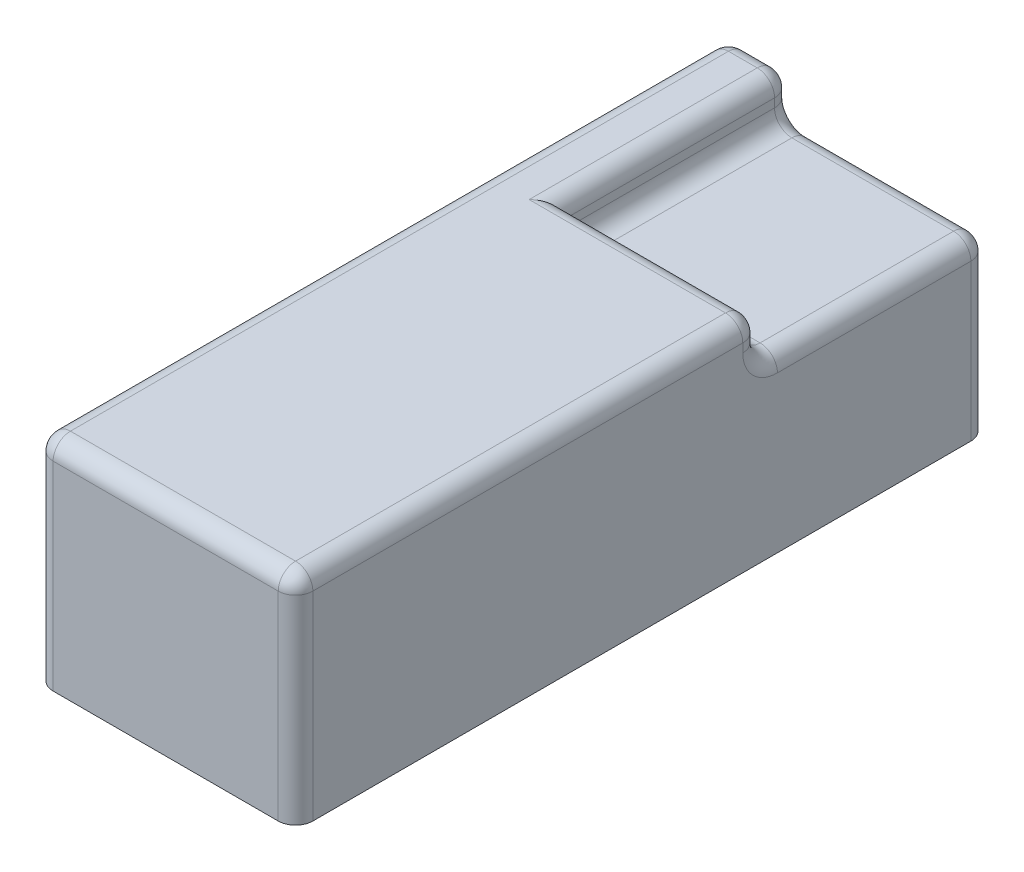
ISO-10303-21;
HEADER;
FILE_DESCRIPTION(('STEP AP214'),'2;1');
FILE_NAME('part.step','',(''),(''),'','','');
FILE_SCHEMA(('AUTOMOTIVE_DESIGN { 1 0 10303 214 1 1 1 1 }'));
ENDSEC;
DATA;
#1=APPLICATION_CONTEXT('core data for automotive mechanical design processes');
#2=APPLICATION_PROTOCOL_DEFINITION('international standard','automotive_design',2000,#1);
#3=PRODUCT_CONTEXT('',#1,'mechanical');
#4=PRODUCT('Part','Part','',(#3));
#5=PRODUCT_RELATED_PRODUCT_CATEGORY('part','',(#4));
#6=PRODUCT_DEFINITION_FORMATION('','',#4);
#7=PRODUCT_DEFINITION_CONTEXT('part definition',#1,'design');
#8=PRODUCT_DEFINITION('design','',#6,#7);
#9=PRODUCT_DEFINITION_SHAPE('','',#8);
#10=(LENGTH_UNIT() NAMED_UNIT(*) SI_UNIT(.MILLI.,.METRE.));
#11=(NAMED_UNIT(*) PLANE_ANGLE_UNIT() SI_UNIT($,.RADIAN.));
#12=(NAMED_UNIT(*) SI_UNIT($,.STERADIAN.) SOLID_ANGLE_UNIT());
#13=UNCERTAINTY_MEASURE_WITH_UNIT(LENGTH_MEASURE(1.E-05),#10,'distance_accuracy_value','');
#14=(GEOMETRIC_REPRESENTATION_CONTEXT(3) GLOBAL_UNCERTAINTY_ASSIGNED_CONTEXT((#13)) GLOBAL_UNIT_ASSIGNED_CONTEXT((#10,
#11,#12)) REPRESENTATION_CONTEXT('',''));
#15=CARTESIAN_POINT('',(0.,0.,0.));
#16=DIRECTION('',(0.,0.,1.));
#17=DIRECTION('',(1.,0.,0.));
#18=AXIS2_PLACEMENT_3D('',#15,#16,#17);
#19=CARTESIAN_POINT('',(0.,0.,-80.));
#20=DIRECTION('',(0.,-1.,0.));
#21=DIRECTION('',(0.,0.,-1.));
#22=AXIS2_PLACEMENT_3D('',#19,#20,#21);
#23=PLANE('',#22);
#24=DIRECTION('',(0.,0.,-1.));
#25=VECTOR('',#24,1.);
#26=CARTESIAN_POINT('',(30.,0.,0.));
#27=LINE('',#26,#25);
#28=CARTESIAN_POINT('',(30.,0.,-2.));
#29=VERTEX_POINT('',#28);
#30=CARTESIAN_POINT('',(30.,0.,-78.));
#31=VERTEX_POINT('',#30);
#32=EDGE_CURVE('E212',#29,#31,#27,.T.);
#33=ORIENTED_EDGE('',*,*,#32,.F.);
#34=CARTESIAN_POINT('',(28.,0.,-2.));
#35=DIRECTION('',(0.,-1.,0.));
#36=DIRECTION('',(0.,0.,-1.));
#37=AXIS2_PLACEMENT_3D('',#34,#35,#36);
#38=CIRCLE('',#37,2.);
#39=CARTESIAN_POINT('',(28.,0.,0.));
#40=VERTEX_POINT('',#39);
#41=EDGE_CURVE('E246',#29,#40,#38,.T.);
#42=ORIENTED_EDGE('',*,*,#41,.T.);
#43=DIRECTION('',(1.,0.,0.));
#44=VECTOR('',#43,1.);
#45=CARTESIAN_POINT('',(0.,0.,0.));
#46=LINE('',#45,#44);
#47=CARTESIAN_POINT('',(2.,0.,0.));
#48=VERTEX_POINT('',#47);
#49=EDGE_CURVE('E358',#48,#40,#46,.T.);
#50=ORIENTED_EDGE('',*,*,#49,.F.);
#51=CARTESIAN_POINT('',(2.,0.,-2.));
#52=DIRECTION('',(0.,-1.,0.));
#53=DIRECTION('',(0.,0.,-1.));
#54=AXIS2_PLACEMENT_3D('',#51,#52,#53);
#55=CIRCLE('',#54,2.);
#56=CARTESIAN_POINT('',(0.,0.,-2.));
#57=VERTEX_POINT('',#56);
#58=EDGE_CURVE('E244',#48,#57,#55,.T.);
#59=ORIENTED_EDGE('',*,*,#58,.T.);
#60=DIRECTION('',(0.,0.,1.));
#61=VECTOR('',#60,1.);
#62=CARTESIAN_POINT('',(0.,0.,0.));
#63=LINE('',#62,#61);
#64=CARTESIAN_POINT('',(0.,0.,-78.));
#65=VERTEX_POINT('',#64);
#66=EDGE_CURVE('E266',#65,#57,#63,.T.);
#67=ORIENTED_EDGE('',*,*,#66,.F.);
#68=CARTESIAN_POINT('',(2.,0.,-78.));
#69=DIRECTION('',(0.,-1.,0.));
#70=DIRECTION('',(0.,0.,-1.));
#71=AXIS2_PLACEMENT_3D('',#68,#69,#70);
#72=CIRCLE('',#71,2.);
#73=CARTESIAN_POINT('',(2.,0.,-80.));
#74=VERTEX_POINT('',#73);
#75=EDGE_CURVE('E240',#65,#74,#72,.T.);
#76=ORIENTED_EDGE('',*,*,#75,.T.);
#77=DIRECTION('',(-1.,0.,0.));
#78=VECTOR('',#77,1.);
#79=CARTESIAN_POINT('',(0.,0.,-80.));
#80=LINE('',#79,#78);
#81=CARTESIAN_POINT('',(28.,0.,-80.));
#82=VERTEX_POINT('',#81);
#83=EDGE_CURVE('E208',#82,#74,#80,.T.);
#84=ORIENTED_EDGE('',*,*,#83,.F.);
#85=CARTESIAN_POINT('',(28.,0.,-78.));
#86=DIRECTION('',(0.,-1.,0.));
#87=DIRECTION('',(0.,0.,-1.));
#88=AXIS2_PLACEMENT_3D('',#85,#86,#87);
#89=CIRCLE('',#88,2.);
#90=EDGE_CURVE('E242',#82,#31,#89,.T.);
#91=ORIENTED_EDGE('',*,*,#90,.T.);
#92=EDGE_LOOP('',(#33,#42,#50,#59,#67,#76,#84,#91));
#93=FACE_BOUND('',#92,.T.);
#94=CARTESIAN_POINT('',(15.,0.,-71.6553218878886));
#95=DIRECTION('',(0.,-1.,0.));
#96=DIRECTION('',(0.,0.,-1.));
#97=AXIS2_PLACEMENT_3D('',#94,#95,#96);
#98=CIRCLE('',#97,4.41834885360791);
#99=CARTESIAN_POINT('',(15.,0.,-76.0736707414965));
#100=VERTEX_POINT('',#99);
#101=EDGE_CURVE('E354',#100,#100,#98,.T.);
#102=ORIENTED_EDGE('',*,*,#101,.F.);
#103=EDGE_LOOP('',(#102));
#104=FACE_BOUND('',#103,.T.);
#105=ADVANCED_FACE('F39',(#93,#104),#23,.T.);
#106=CARTESIAN_POINT('',(28.,25.,-78.));
#107=DIRECTION('',(0.,-1.,0.));
#108=DIRECTION('',(0.,0.,-1.));
#109=AXIS2_PLACEMENT_3D('',#106,#107,#108);
#110=CYLINDRICAL_SURFACE('',#109,2.);
#111=DIRECTION('',(0.,-1.,0.));
#112=VECTOR('',#111,1.);
#113=CARTESIAN_POINT('',(28.,25.,-80.));
#114=LINE('',#113,#112);
#115=CARTESIAN_POINT('',(28.,18.,-80.));
#116=VERTEX_POINT('',#115);
#117=EDGE_CURVE('E219',#116,#82,#114,.T.);
#118=ORIENTED_EDGE('',*,*,#117,.F.);
#119=CARTESIAN_POINT('',(28.,18.,-78.));
#120=DIRECTION('',(0.,-1.,0.));
#121=DIRECTION('',(0.,0.,-1.));
#122=AXIS2_PLACEMENT_3D('',#119,#120,#121);
#123=CIRCLE('',#122,2.);
#124=CARTESIAN_POINT('',(30.,18.,-78.));
#125=VERTEX_POINT('',#124);
#126=EDGE_CURVE('E11',#116,#125,#123,.T.);
#127=ORIENTED_EDGE('',*,*,#126,.T.);
#128=DIRECTION('',(0.,-1.,0.));
#129=VECTOR('',#128,1.);
#130=CARTESIAN_POINT('',(30.,25.,-78.));
#131=LINE('',#130,#129);
#132=EDGE_CURVE('E221',#31,#125,#131,.F.);
#133=ORIENTED_EDGE('',*,*,#132,.F.);
#134=ORIENTED_EDGE('',*,*,#90,.F.);
#135=EDGE_LOOP('',(#118,#127,#133,#134));
#136=FACE_BOUND('',#135,.T.);
#137=ADVANCED_FACE('F371',(#136),#110,.T.);
#138=CARTESIAN_POINT('',(0.,25.,0.));
#139=DIRECTION('',(1.,0.,0.));
#140=DIRECTION('',(0.,0.,-1.));
#141=AXIS2_PLACEMENT_3D('',#138,#139,#140);
#142=PLANE('',#141);
#143=ORIENTED_EDGE('',*,*,#66,.T.);
#144=DIRECTION('',(0.,-1.,0.));
#145=VECTOR('',#144,1.);
#146=CARTESIAN_POINT('',(0.,25.,-2.));
#147=LINE('',#146,#145);
#148=CARTESIAN_POINT('',(0.,23.,-2.));
#149=VERTEX_POINT('',#148);
#150=EDGE_CURVE('E238',#57,#149,#147,.F.);
#151=ORIENTED_EDGE('',*,*,#150,.T.);
#152=DIRECTION('',(0.,0.,1.));
#153=VECTOR('',#152,1.);
#154=CARTESIAN_POINT('',(0.,23.,0.));
#155=LINE('',#154,#153);
#156=CARTESIAN_POINT('',(0.,23.,-78.));
#157=VERTEX_POINT('',#156);
#158=EDGE_CURVE('E236',#149,#157,#155,.F.);
#159=ORIENTED_EDGE('',*,*,#158,.T.);
#160=DIRECTION('',(0.,-1.,0.));
#161=VECTOR('',#160,1.);
#162=CARTESIAN_POINT('',(0.,25.,-78.));
#163=LINE('',#162,#161);
#164=EDGE_CURVE('E234',#157,#65,#163,.T.);
#165=ORIENTED_EDGE('',*,*,#164,.T.);
#166=EDGE_LOOP('',(#143,#151,#159,#165));
#167=FACE_BOUND('',#166,.T.);
#168=ADVANCED_FACE('F435',(#167),#142,.F.);
#169=CARTESIAN_POINT('',(0.,25.,0.));
#170=DIRECTION('',(0.,0.,-1.));
#171=DIRECTION('',(-1.,0.,0.));
#172=AXIS2_PLACEMENT_3D('',#169,#170,#171);
#173=PLANE('',#172);
#174=ORIENTED_EDGE('',*,*,#49,.T.);
#175=DIRECTION('',(0.,-1.,0.));
#176=VECTOR('',#175,1.);
#177=CARTESIAN_POINT('',(28.,25.,0.));
#178=LINE('',#177,#176);
#179=CARTESIAN_POINT('',(28.,23.,0.));
#180=VERTEX_POINT('',#179);
#181=EDGE_CURVE('E232',#40,#180,#178,.F.);
#182=ORIENTED_EDGE('',*,*,#181,.T.);
#183=DIRECTION('',(1.,0.,0.));
#184=VECTOR('',#183,1.);
#185=CARTESIAN_POINT('',(0.,23.,0.));
#186=LINE('',#185,#184);
#187=CARTESIAN_POINT('',(2.,23.,0.));
#188=VERTEX_POINT('',#187);
#189=EDGE_CURVE('E230',#180,#188,#186,.F.);
#190=ORIENTED_EDGE('',*,*,#189,.T.);
#191=DIRECTION('',(0.,-1.,0.));
#192=VECTOR('',#191,1.);
#193=CARTESIAN_POINT('',(2.,25.,0.));
#194=LINE('',#193,#192);
#195=EDGE_CURVE('E228',#188,#48,#194,.T.);
#196=ORIENTED_EDGE('',*,*,#195,.T.);
#197=EDGE_LOOP('',(#174,#182,#190,#196));
#198=FACE_BOUND('',#197,.T.);
#199=ADVANCED_FACE('F444',(#198),#173,.F.);
#200=CARTESIAN_POINT('',(30.,25.,0.));
#201=DIRECTION('',(-1.,0.,0.));
#202=DIRECTION('',(0.,0.,1.));
#203=AXIS2_PLACEMENT_3D('',#200,#201,#202);
#204=PLANE('',#203);
#205=CARTESIAN_POINT('',(30.,22.,-55.6549345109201));
#206=DIRECTION('',(-1.,0.,0.));
#207=DIRECTION('',(0.,0.,1.));
#208=AXIS2_PLACEMENT_3D('',#205,#206,#207);
#209=CIRCLE('',#208,4.);
#210=CARTESIAN_POINT('',(30.,22.,-51.6549345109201));
#211=VERTEX_POINT('',#210);
#212=CARTESIAN_POINT('',(30.,18.,-55.6549345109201));
#213=VERTEX_POINT('',#212);
#214=EDGE_CURVE('E286',#211,#213,#209,.F.);
#215=ORIENTED_EDGE('',*,*,#214,.F.);
#216=DIRECTION('',(0.,1.,0.));
#217=VECTOR('',#216,1.);
#218=CARTESIAN_POINT('',(30.,25.,-51.6549345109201));
#219=LINE('',#218,#217);
#220=CARTESIAN_POINT('',(30.,23.,-51.6549345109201));
#221=VERTEX_POINT('',#220);
#222=EDGE_CURVE('E291',#211,#221,#219,.T.);
#223=ORIENTED_EDGE('',*,*,#222,.T.);
#224=DIRECTION('',(0.,0.,-1.));
#225=VECTOR('',#224,1.);
#226=CARTESIAN_POINT('',(30.,23.,0.));
#227=LINE('',#226,#225);
#228=CARTESIAN_POINT('',(30.,23.,-2.));
#229=VERTEX_POINT('',#228);
#230=EDGE_CURVE('E224',#221,#229,#227,.F.);
#231=ORIENTED_EDGE('',*,*,#230,.T.);
#232=DIRECTION('',(0.,-1.,0.));
#233=VECTOR('',#232,1.);
#234=CARTESIAN_POINT('',(30.,25.,-2.));
#235=LINE('',#234,#233);
#236=EDGE_CURVE('E226',#229,#29,#235,.T.);
#237=ORIENTED_EDGE('',*,*,#236,.T.);
#238=ORIENTED_EDGE('',*,*,#32,.T.);
#239=ORIENTED_EDGE('',*,*,#132,.T.);
#240=DIRECTION('',(0.,0.,-1.));
#241=VECTOR('',#240,1.);
#242=CARTESIAN_POINT('',(30.,18.,-53.6549345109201));
#243=LINE('',#242,#241);
#244=EDGE_CURVE('E289',#125,#213,#243,.F.);
#245=ORIENTED_EDGE('',*,*,#244,.T.);
#246=EDGE_LOOP('',(#215,#223,#231,#237,#238,#239,#245));
#247=FACE_BOUND('',#246,.T.);
#248=ADVANCED_FACE('F364',(#247),#204,.F.);
#249=CARTESIAN_POINT('',(0.,25.,-80.));
#250=DIRECTION('',(0.,0.,1.));
#251=DIRECTION('',(1.,0.,0.));
#252=AXIS2_PLACEMENT_3D('',#249,#250,#251);
#253=PLANE('',#252);
#254=DIRECTION('',(-1.,0.,0.));
#255=VECTOR('',#254,1.);
#256=CARTESIAN_POINT('',(0.,23.,-80.));
#257=LINE('',#256,#255);
#258=CARTESIAN_POINT('',(2.,23.,-80.));
#259=VERTEX_POINT('',#258);
#260=CARTESIAN_POINT('',(5.32456832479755,23.,-80.));
#261=VERTEX_POINT('',#260);
#262=EDGE_CURVE('E190',#259,#261,#257,.F.);
#263=ORIENTED_EDGE('',*,*,#262,.T.);
#264=DIRECTION('',(0.,-1.,0.));
#265=VECTOR('',#264,1.);
#266=CARTESIAN_POINT('',(5.32456832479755,25.,-80.));
#267=LINE('',#266,#265);
#268=CARTESIAN_POINT('',(5.32456832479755,22.,-80.));
#269=VERTEX_POINT('',#268);
#270=EDGE_CURVE('E298',#261,#269,#267,.T.);
#271=ORIENTED_EDGE('',*,*,#270,.T.);
#272=CARTESIAN_POINT('',(9.32456832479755,22.,-80.));
#273=DIRECTION('',(0.,0.,1.));
#274=DIRECTION('',(1.,0.,0.));
#275=AXIS2_PLACEMENT_3D('',#272,#273,#274);
#276=CIRCLE('',#275,4.);
#277=CARTESIAN_POINT('',(9.32456832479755,18.,-80.));
#278=VERTEX_POINT('',#277);
#279=EDGE_CURVE('E295',#278,#269,#276,.F.);
#280=ORIENTED_EDGE('',*,*,#279,.F.);
#281=DIRECTION('',(-1.,0.,0.));
#282=VECTOR('',#281,1.);
#283=CARTESIAN_POINT('',(28.,18.,-80.));
#284=LINE('',#283,#282);
#285=EDGE_CURVE('E293',#278,#116,#284,.F.);
#286=ORIENTED_EDGE('',*,*,#285,.T.);
#287=ORIENTED_EDGE('',*,*,#117,.T.);
#288=ORIENTED_EDGE('',*,*,#83,.T.);
#289=DIRECTION('',(0.,-1.,0.));
#290=VECTOR('',#289,1.);
#291=CARTESIAN_POINT('',(2.,25.,-80.));
#292=LINE('',#291,#290);
#293=EDGE_CURVE('E181',#74,#259,#292,.F.);
#294=ORIENTED_EDGE('',*,*,#293,.T.);
#295=EDGE_LOOP('',(#263,#271,#280,#286,#287,#288,#294));
#296=FACE_BOUND('',#295,.T.);
#297=ADVANCED_FACE('F409',(#296),#253,.F.);
#298=CARTESIAN_POINT('',(0.,25.,-80.));
#299=DIRECTION('',(0.,-1.,0.));
#300=DIRECTION('',(0.,0.,-1.));
#301=AXIS2_PLACEMENT_3D('',#298,#299,#300);
#302=PLANE('',#301);
#303=DIRECTION('',(0.,0.,-1.));
#304=VECTOR('',#303,1.);
#305=CARTESIAN_POINT('',(28.,25.,-80.));
#306=LINE('',#305,#304);
#307=CARTESIAN_POINT('',(28.,25.,-2.));
#308=VERTEX_POINT('',#307);
#309=CARTESIAN_POINT('',(28.,25.,-51.6549345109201));
#310=VERTEX_POINT('',#309);
#311=EDGE_CURVE('E182',#308,#310,#306,.T.);
#312=ORIENTED_EDGE('',*,*,#311,.T.);
#313=DIRECTION('',(1.,0.,0.));
#314=VECTOR('',#313,1.);
#315=CARTESIAN_POINT('',(0.,25.,-51.6549345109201));
#316=LINE('',#315,#314);
#317=CARTESIAN_POINT('',(5.32456832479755,25.,-51.6549345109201));
#318=VERTEX_POINT('',#317);
#319=EDGE_CURVE('E274',#310,#318,#316,.F.);
#320=ORIENTED_EDGE('',*,*,#319,.T.);
#321=DIRECTION('',(0.,0.,1.));
#322=VECTOR('',#321,1.);
#323=CARTESIAN_POINT('',(5.32456832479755,25.,-80.));
#324=LINE('',#323,#322);
#325=CARTESIAN_POINT('',(5.32456832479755,25.,-78.));
#326=VERTEX_POINT('',#325);
#327=EDGE_CURVE('E178',#318,#326,#324,.F.);
#328=ORIENTED_EDGE('',*,*,#327,.T.);
#329=DIRECTION('',(-1.,0.,0.));
#330=VECTOR('',#329,1.);
#331=CARTESIAN_POINT('',(0.,25.,-78.));
#332=LINE('',#331,#330);
#333=CARTESIAN_POINT('',(2.,25.,-78.));
#334=VERTEX_POINT('',#333);
#335=EDGE_CURVE('E169',#326,#334,#332,.T.);
#336=ORIENTED_EDGE('',*,*,#335,.T.);
#337=DIRECTION('',(0.,0.,1.));
#338=VECTOR('',#337,1.);
#339=CARTESIAN_POINT('',(2.,25.,-80.));
#340=LINE('',#339,#338);
#341=CARTESIAN_POINT('',(2.,25.,-2.));
#342=VERTEX_POINT('',#341);
#343=EDGE_CURVE('E174',#334,#342,#340,.T.);
#344=ORIENTED_EDGE('',*,*,#343,.T.);
#345=DIRECTION('',(1.,0.,0.));
#346=VECTOR('',#345,1.);
#347=CARTESIAN_POINT('',(0.,25.,-2.));
#348=LINE('',#347,#346);
#349=EDGE_CURVE('E207',#342,#308,#348,.T.);
#350=ORIENTED_EDGE('',*,*,#349,.T.);
#351=EDGE_LOOP('',(#312,#320,#328,#336,#344,#350));
#352=FACE_BOUND('',#351,.T.);
#353=ADVANCED_FACE('F172',(#352),#302,.F.);
#354=CARTESIAN_POINT('',(28.,25.,-2.));
#355=DIRECTION('',(0.,-1.,0.));
#356=DIRECTION('',(0.,0.,-1.));
#357=AXIS2_PLACEMENT_3D('',#354,#355,#356);
#358=CYLINDRICAL_SURFACE('',#357,2.);
#359=ORIENTED_EDGE('',*,*,#41,.F.);
#360=ORIENTED_EDGE('',*,*,#236,.F.);
#361=CARTESIAN_POINT('',(28.,23.,-2.));
#362=DIRECTION('',(0.,1.,0.));
#363=DIRECTION('',(0.,0.,1.));
#364=AXIS2_PLACEMENT_3D('',#361,#362,#363);
#365=CIRCLE('',#364,2.);
#366=EDGE_CURVE('E263',#180,#229,#365,.T.);
#367=ORIENTED_EDGE('',*,*,#366,.F.);
#368=ORIENTED_EDGE('',*,*,#181,.F.);
#369=EDGE_LOOP('',(#359,#360,#367,#368));
#370=FACE_BOUND('',#369,.T.);
#371=ADVANCED_FACE('F479',(#370),#358,.T.);
#372=CARTESIAN_POINT('',(0.,23.,-2.));
#373=DIRECTION('',(1.,0.,0.));
#374=DIRECTION('',(0.,0.,-1.));
#375=AXIS2_PLACEMENT_3D('',#372,#373,#374);
#376=CYLINDRICAL_SURFACE('',#375,2.);
#377=CARTESIAN_POINT('',(2.,23.,-2.));
#378=DIRECTION('',(-1.,0.,0.));
#379=DIRECTION('',(0.,0.,1.));
#380=AXIS2_PLACEMENT_3D('',#377,#378,#379);
#381=CIRCLE('',#380,2.);
#382=EDGE_CURVE('E257',#188,#342,#381,.T.);
#383=ORIENTED_EDGE('',*,*,#382,.F.);
#384=ORIENTED_EDGE('',*,*,#189,.F.);
#385=CARTESIAN_POINT('',(28.,23.,-2.));
#386=DIRECTION('',(1.,0.,0.));
#387=DIRECTION('',(0.,0.,-1.));
#388=AXIS2_PLACEMENT_3D('',#385,#386,#387);
#389=CIRCLE('',#388,2.);
#390=EDGE_CURVE('E260',#308,#180,#389,.T.);
#391=ORIENTED_EDGE('',*,*,#390,.F.);
#392=ORIENTED_EDGE('',*,*,#349,.F.);
#393=EDGE_LOOP('',(#383,#384,#391,#392));
#394=FACE_BOUND('',#393,.T.);
#395=ADVANCED_FACE('F475',(#394),#376,.T.);
#396=CARTESIAN_POINT('',(2.,25.,-2.));
#397=DIRECTION('',(0.,-1.,0.));
#398=DIRECTION('',(0.,0.,-1.));
#399=AXIS2_PLACEMENT_3D('',#396,#397,#398);
#400=CYLINDRICAL_SURFACE('',#399,2.);
#401=ORIENTED_EDGE('',*,*,#58,.F.);
#402=ORIENTED_EDGE('',*,*,#195,.F.);
#403=CARTESIAN_POINT('',(2.,23.,-2.));
#404=DIRECTION('',(0.,1.,0.));
#405=DIRECTION('',(0.,0.,1.));
#406=AXIS2_PLACEMENT_3D('',#403,#404,#405);
#407=CIRCLE('',#406,2.);
#408=EDGE_CURVE('E254',#149,#188,#407,.T.);
#409=ORIENTED_EDGE('',*,*,#408,.F.);
#410=ORIENTED_EDGE('',*,*,#150,.F.);
#411=EDGE_LOOP('',(#401,#402,#409,#410));
#412=FACE_BOUND('',#411,.T.);
#413=ADVANCED_FACE('F471',(#412),#400,.T.);
#414=CARTESIAN_POINT('',(28.,23.,-2.));
#415=DIRECTION('',(0.,0.,1.));
#416=DIRECTION('',(1.,0.,0.));
#417=AXIS2_PLACEMENT_3D('',#414,#415,#416);
#418=SPHERICAL_SURFACE('',#417,2.);
#419=ORIENTED_EDGE('',*,*,#390,.T.);
#420=ORIENTED_EDGE('',*,*,#366,.T.);
#421=CARTESIAN_POINT('',(28.,23.,-2.));
#422=DIRECTION('',(0.,0.,1.));
#423=DIRECTION('',(0.,-1.,0.));
#424=AXIS2_PLACEMENT_3D('',#421,#422,#423);
#425=CIRCLE('',#424,2.);
#426=EDGE_CURVE('E251',#308,#229,#425,.F.);
#427=ORIENTED_EDGE('',*,*,#426,.F.);
#428=EDGE_LOOP('',(#419,#420,#427));
#429=FACE_BOUND('',#428,.T.);
#430=ADVANCED_FACE('F467',(#429),#418,.T.);
#431=CARTESIAN_POINT('',(2.,23.,-2.));
#432=DIRECTION('',(0.,0.,1.));
#433=DIRECTION('',(1.,0.,0.));
#434=AXIS2_PLACEMENT_3D('',#431,#432,#433);
#435=SPHERICAL_SURFACE('',#434,2.);
#436=ORIENTED_EDGE('',*,*,#408,.T.);
#437=ORIENTED_EDGE('',*,*,#382,.T.);
#438=CARTESIAN_POINT('',(2.,23.,-2.));
#439=DIRECTION('',(0.,0.,1.));
#440=DIRECTION('',(1.,0.,0.));
#441=AXIS2_PLACEMENT_3D('',#438,#439,#440);
#442=CIRCLE('',#441,2.);
#443=EDGE_CURVE('E202',#149,#342,#442,.F.);
#444=ORIENTED_EDGE('',*,*,#443,.F.);
#445=EDGE_LOOP('',(#436,#437,#444));
#446=FACE_BOUND('',#445,.T.);
#447=ADVANCED_FACE('F463',(#446),#435,.T.);
#448=CARTESIAN_POINT('',(28.,23.,-80.));
#449=DIRECTION('',(0.,0.,-1.));
#450=DIRECTION('',(-1.,0.,0.));
#451=AXIS2_PLACEMENT_3D('',#448,#449,#450);
#452=CYLINDRICAL_SURFACE('',#451,2.);
#453=ORIENTED_EDGE('',*,*,#230,.F.);
#454=CARTESIAN_POINT('',(28.,23.,-51.6549345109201));
#455=DIRECTION('',(0.,0.,-1.));
#456=DIRECTION('',(-1.,0.,0.));
#457=AXIS2_PLACEMENT_3D('',#454,#455,#456);
#458=CIRCLE('',#457,2.);
#459=EDGE_CURVE('E282',#221,#310,#458,.F.);
#460=ORIENTED_EDGE('',*,*,#459,.T.);
#461=ORIENTED_EDGE('',*,*,#311,.F.);
#462=ORIENTED_EDGE('',*,*,#426,.T.);
#463=EDGE_LOOP('',(#453,#460,#461,#462));
#464=FACE_BOUND('',#463,.T.);
#465=ADVANCED_FACE('F394',(#464),#452,.T.);
#466=CARTESIAN_POINT('',(2.,23.,-80.));
#467=DIRECTION('',(0.,0.,1.));
#468=DIRECTION('',(1.,0.,0.));
#469=AXIS2_PLACEMENT_3D('',#466,#467,#468);
#470=CYLINDRICAL_SURFACE('',#469,2.);
#471=ORIENTED_EDGE('',*,*,#443,.T.);
#472=ORIENTED_EDGE('',*,*,#343,.F.);
#473=CARTESIAN_POINT('',(2.,23.,-78.));
#474=DIRECTION('',(0.,0.,-1.));
#475=DIRECTION('',(-1.,0.,0.));
#476=AXIS2_PLACEMENT_3D('',#473,#474,#475);
#477=CIRCLE('',#476,2.);
#478=EDGE_CURVE('E197',#157,#334,#477,.T.);
#479=ORIENTED_EDGE('',*,*,#478,.F.);
#480=ORIENTED_EDGE('',*,*,#158,.F.);
#481=EDGE_LOOP('',(#471,#472,#479,#480));
#482=FACE_BOUND('',#481,.T.);
#483=ADVANCED_FACE('F205',(#482),#470,.T.);
#484=CARTESIAN_POINT('',(2.,25.,-78.));
#485=DIRECTION('',(0.,-1.,0.));
#486=DIRECTION('',(0.,0.,-1.));
#487=AXIS2_PLACEMENT_3D('',#484,#485,#486);
#488=CYLINDRICAL_SURFACE('',#487,2.);
#489=ORIENTED_EDGE('',*,*,#75,.F.);
#490=ORIENTED_EDGE('',*,*,#164,.F.);
#491=CARTESIAN_POINT('',(2.,23.,-78.));
#492=DIRECTION('',(0.,1.,0.));
#493=DIRECTION('',(0.,0.,1.));
#494=AXIS2_PLACEMENT_3D('',#491,#492,#493);
#495=CIRCLE('',#494,2.);
#496=EDGE_CURVE('E193',#259,#157,#495,.T.);
#497=ORIENTED_EDGE('',*,*,#496,.F.);
#498=ORIENTED_EDGE('',*,*,#293,.F.);
#499=EDGE_LOOP('',(#489,#490,#497,#498));
#500=FACE_BOUND('',#499,.T.);
#501=ADVANCED_FACE('F456',(#500),#488,.T.);
#502=CARTESIAN_POINT('',(2.,23.,-78.));
#503=DIRECTION('',(0.,0.,1.));
#504=DIRECTION('',(1.,0.,0.));
#505=AXIS2_PLACEMENT_3D('',#502,#503,#504);
#506=SPHERICAL_SURFACE('',#505,2.);
#507=ORIENTED_EDGE('',*,*,#496,.T.);
#508=ORIENTED_EDGE('',*,*,#478,.T.);
#509=CARTESIAN_POINT('',(2.,23.,-78.));
#510=DIRECTION('',(-1.,0.,0.));
#511=DIRECTION('',(0.,0.,1.));
#512=AXIS2_PLACEMENT_3D('',#509,#510,#511);
#513=CIRCLE('',#512,2.);
#514=EDGE_CURVE('E186',#259,#334,#513,.F.);
#515=ORIENTED_EDGE('',*,*,#514,.F.);
#516=EDGE_LOOP('',(#507,#508,#515));
#517=FACE_BOUND('',#516,.T.);
#518=ADVANCED_FACE('F198',(#517),#506,.T.);
#519=CARTESIAN_POINT('',(0.,23.,-78.));
#520=DIRECTION('',(-1.,0.,0.));
#521=DIRECTION('',(0.,0.,1.));
#522=AXIS2_PLACEMENT_3D('',#519,#520,#521);
#523=CYLINDRICAL_SURFACE('',#522,2.);
#524=ORIENTED_EDGE('',*,*,#335,.F.);
#525=CARTESIAN_POINT('',(5.32456832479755,23.,-78.));
#526=DIRECTION('',(-1.,0.,0.));
#527=DIRECTION('',(0.,0.,1.));
#528=AXIS2_PLACEMENT_3D('',#525,#526,#527);
#529=CIRCLE('',#528,2.);
#530=EDGE_CURVE('E284',#326,#261,#529,.T.);
#531=ORIENTED_EDGE('',*,*,#530,.T.);
#532=ORIENTED_EDGE('',*,*,#262,.F.);
#533=ORIENTED_EDGE('',*,*,#514,.T.);
#534=EDGE_LOOP('',(#524,#531,#532,#533));
#535=FACE_BOUND('',#534,.T.);
#536=ADVANCED_FACE('F188',(#535),#523,.T.);
#537=CARTESIAN_POINT('',(7.32456832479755,20.,-53.6549345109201));
#538=DIRECTION('',(0.,1.,0.));
#539=DIRECTION('',(0.,0.,1.));
#540=AXIS2_PLACEMENT_3D('',#537,#538,#539);
#541=PLANE('',#540);
#542=DIRECTION('',(0.,0.,1.));
#543=VECTOR('',#542,1.);
#544=CARTESIAN_POINT('',(9.32456832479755,20.,-53.6549345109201));
#545=LINE('',#544,#543);
#546=CARTESIAN_POINT('',(9.32456832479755,20.,-78.));
#547=VERTEX_POINT('',#546);
#548=CARTESIAN_POINT('',(9.32456832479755,20.,-55.6549345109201));
#549=VERTEX_POINT('',#548);
#550=EDGE_CURVE('E56',#547,#549,#545,.T.);
#551=ORIENTED_EDGE('',*,*,#550,.T.);
#552=DIRECTION('',(1.,0.,0.));
#553=VECTOR('',#552,1.);
#554=CARTESIAN_POINT('',(7.32456832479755,20.,-55.6549345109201));
#555=LINE('',#554,#553);
#556=CARTESIAN_POINT('',(28.,20.,-55.6549345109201));
#557=VERTEX_POINT('',#556);
#558=EDGE_CURVE('E48',#549,#557,#555,.T.);
#559=ORIENTED_EDGE('',*,*,#558,.T.);
#560=DIRECTION('',(0.,0.,-1.));
#561=VECTOR('',#560,1.);
#562=CARTESIAN_POINT('',(28.,20.,-78.));
#563=LINE('',#562,#561);
#564=CARTESIAN_POINT('',(28.,20.,-78.));
#565=VERTEX_POINT('',#564);
#566=EDGE_CURVE('E300',#557,#565,#563,.T.);
#567=ORIENTED_EDGE('',*,*,#566,.T.);
#568=DIRECTION('',(-1.,0.,0.));
#569=VECTOR('',#568,1.);
#570=CARTESIAN_POINT('',(7.32456832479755,20.,-78.));
#571=LINE('',#570,#569);
#572=EDGE_CURVE('E61',#565,#547,#571,.T.);
#573=ORIENTED_EDGE('',*,*,#572,.T.);
#574=EDGE_LOOP('',(#551,#559,#567,#573));
#575=FACE_BOUND('',#574,.T.);
#576=ADVANCED_FACE('F453',(#575),#541,.T.);
#577=CARTESIAN_POINT('',(7.32456832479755,20.,-53.6549345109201));
#578=DIRECTION('',(0.,0.,1.));
#579=DIRECTION('',(1.,0.,0.));
#580=AXIS2_PLACEMENT_3D('',#577,#578,#579);
#581=PLANE('',#580);
#582=DIRECTION('',(0.,1.,0.));
#583=VECTOR('',#582,1.);
#584=CARTESIAN_POINT('',(7.32456832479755,20.,-53.6549345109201));
#585=LINE('',#584,#583);
#586=CARTESIAN_POINT('',(7.32456832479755,22.,-53.6549345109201));
#587=VERTEX_POINT('',#586);
#588=CARTESIAN_POINT('',(7.32456832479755,23.,-53.6549345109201));
#589=VERTEX_POINT('',#588);
#590=EDGE_CURVE('E194',#587,#589,#585,.T.);
#591=ORIENTED_EDGE('',*,*,#590,.T.);
#592=DIRECTION('',(1.,0.,0.));
#593=VECTOR('',#592,1.);
#594=CARTESIAN_POINT('',(7.32456832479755,23.,-53.6549345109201));
#595=LINE('',#594,#593);
#596=CARTESIAN_POINT('',(28.,23.,-53.6549345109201));
#597=VERTEX_POINT('',#596);
#598=EDGE_CURVE('E270',#589,#597,#595,.T.);
#599=ORIENTED_EDGE('',*,*,#598,.T.);
#600=DIRECTION('',(0.,1.,0.));
#601=VECTOR('',#600,1.);
#602=CARTESIAN_POINT('',(28.,20.,-53.6549345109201));
#603=LINE('',#602,#601);
#604=CARTESIAN_POINT('',(28.,22.,-53.6549345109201));
#605=VERTEX_POINT('',#604);
#606=EDGE_CURVE('E268',#597,#605,#603,.F.);
#607=ORIENTED_EDGE('',*,*,#606,.T.);
#608=DIRECTION('',(1.,0.,0.));
#609=VECTOR('',#608,1.);
#610=CARTESIAN_POINT('',(7.32456832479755,22.,-53.6549345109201));
#611=LINE('',#610,#609);
#612=EDGE_CURVE('E247',#605,#587,#611,.F.);
#613=ORIENTED_EDGE('',*,*,#612,.T.);
#614=EDGE_LOOP('',(#591,#599,#607,#613));
#615=FACE_BOUND('',#614,.T.);
#616=ADVANCED_FACE('F427',(#615),#581,.F.);
#617=CARTESIAN_POINT('',(7.32456832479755,20.,-85.3022511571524));
#618=DIRECTION('',(-1.,0.,0.));
#619=DIRECTION('',(0.,0.,1.));
#620=AXIS2_PLACEMENT_3D('',#617,#618,#619);
#621=PLANE('',#620);
#622=DIRECTION('',(0.,-1.,0.));
#623=VECTOR('',#622,1.);
#624=CARTESIAN_POINT('',(7.32456832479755,20.,-78.));
#625=LINE('',#624,#623);
#626=CARTESIAN_POINT('',(7.32456832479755,22.,-78.));
#627=VERTEX_POINT('',#626);
#628=CARTESIAN_POINT('',(7.32456832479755,23.,-78.));
#629=VERTEX_POINT('',#628);
#630=EDGE_CURVE('E278',#627,#629,#625,.F.);
#631=ORIENTED_EDGE('',*,*,#630,.T.);
#632=DIRECTION('',(0.,0.,1.));
#633=VECTOR('',#632,1.);
#634=CARTESIAN_POINT('',(7.32456832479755,23.,-85.3022511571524));
#635=LINE('',#634,#633);
#636=EDGE_CURVE('E280',#629,#589,#635,.T.);
#637=ORIENTED_EDGE('',*,*,#636,.T.);
#638=ORIENTED_EDGE('',*,*,#590,.F.);
#639=DIRECTION('',(0.,0.,1.));
#640=VECTOR('',#639,1.);
#641=CARTESIAN_POINT('',(7.32456832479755,22.,-85.3022511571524));
#642=LINE('',#641,#640);
#643=EDGE_CURVE('E276',#587,#627,#642,.F.);
#644=ORIENTED_EDGE('',*,*,#643,.T.);
#645=EDGE_LOOP('',(#631,#637,#638,#644));
#646=FACE_BOUND('',#645,.T.);
#647=ADVANCED_FACE('F421',(#646),#621,.F.);
#648=CARTESIAN_POINT('',(7.32456832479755,18.,-78.));
#649=DIRECTION('',(1.,0.,0.));
#650=DIRECTION('',(0.,0.,-1.));
#651=AXIS2_PLACEMENT_3D('',#648,#649,#650);
#652=CYLINDRICAL_SURFACE('',#651,2.);
#653=CARTESIAN_POINT('',(9.32456832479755,18.,-78.));
#654=DIRECTION('',(-1.,0.,0.));
#655=DIRECTION('',(0.,0.,1.));
#656=AXIS2_PLACEMENT_3D('',#653,#654,#655);
#657=CIRCLE('',#656,2.);
#658=EDGE_CURVE('E338',#547,#278,#657,.T.);
#659=ORIENTED_EDGE('',*,*,#658,.F.);
#660=ORIENTED_EDGE('',*,*,#572,.F.);
#661=CARTESIAN_POINT('',(28.,18.,-78.));
#662=DIRECTION('',(1.,0.,0.));
#663=DIRECTION('',(0.,0.,-1.));
#664=AXIS2_PLACEMENT_3D('',#661,#662,#663);
#665=CIRCLE('',#664,2.);
#666=EDGE_CURVE('E43',#116,#565,#665,.T.);
#667=ORIENTED_EDGE('',*,*,#666,.F.);
#668=ORIENTED_EDGE('',*,*,#285,.F.);
#669=EDGE_LOOP('',(#659,#660,#667,#668));
#670=FACE_BOUND('',#669,.T.);
#671=ADVANCED_FACE('F41',(#670),#652,.T.);
#672=CARTESIAN_POINT('',(9.32456832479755,22.,-53.6549345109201));
#673=DIRECTION('',(0.,0.,1.));
#674=DIRECTION('',(1.,0.,0.));
#675=AXIS2_PLACEMENT_3D('',#672,#673,#674);
#676=CYLINDRICAL_SURFACE('',#675,2.);
#677=CARTESIAN_POINT('',(9.32456832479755,22.,-55.6549345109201));
#678=DIRECTION('',(0.707106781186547,0.,0.707106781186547));
#679=DIRECTION('',(0.707106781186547,0.,-0.707106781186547));
#680=AXIS2_PLACEMENT_3D('',#677,#678,#679);
#681=ELLIPSE('',#680,2.82842712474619,2.);
#682=EDGE_CURVE('E333',#549,#587,#681,.F.);
#683=ORIENTED_EDGE('',*,*,#682,.F.);
#684=ORIENTED_EDGE('',*,*,#550,.F.);
#685=CARTESIAN_POINT('',(9.32456832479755,22.,-78.));
#686=DIRECTION('',(0.,0.,1.));
#687=DIRECTION('',(1.,0.,0.));
#688=AXIS2_PLACEMENT_3D('',#685,#686,#687);
#689=CIRCLE('',#688,2.);
#690=EDGE_CURVE('E336',#627,#547,#689,.T.);
#691=ORIENTED_EDGE('',*,*,#690,.F.);
#692=ORIENTED_EDGE('',*,*,#643,.F.);
#693=EDGE_LOOP('',(#683,#684,#691,#692));
#694=FACE_BOUND('',#693,.T.);
#695=ADVANCED_FACE('F420',(#694),#676,.F.);
#696=CARTESIAN_POINT('',(28.,18.,-78.));
#697=DIRECTION('',(0.,0.,1.));
#698=DIRECTION('',(1.,0.,0.));
#699=AXIS2_PLACEMENT_3D('',#696,#697,#698);
#700=SPHERICAL_SURFACE('',#699,2.);
#701=ORIENTED_EDGE('',*,*,#126,.F.);
#702=ORIENTED_EDGE('',*,*,#666,.T.);
#703=CARTESIAN_POINT('',(28.,18.,-78.));
#704=DIRECTION('',(0.,0.,1.));
#705=DIRECTION('',(1.,0.,0.));
#706=AXIS2_PLACEMENT_3D('',#703,#704,#705);
#707=CIRCLE('',#706,2.);
#708=EDGE_CURVE('E330',#125,#565,#707,.T.);
#709=ORIENTED_EDGE('',*,*,#708,.F.);
#710=EDGE_LOOP('',(#701,#702,#709));
#711=FACE_BOUND('',#710,.T.);
#712=ADVANCED_FACE('F372',(#711),#700,.T.);
#713=CARTESIAN_POINT('',(9.32456832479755,22.,-78.));
#714=DIRECTION('',(0.,0.,1.));
#715=DIRECTION('',(1.,0.,0.));
#716=AXIS2_PLACEMENT_3D('',#713,#714,#715);
#717=TOROIDAL_SURFACE('',#716,4.,2.);
#718=ORIENTED_EDGE('',*,*,#658,.T.);
#719=ORIENTED_EDGE('',*,*,#279,.T.);
#720=CARTESIAN_POINT('',(5.32456832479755,22.,-78.));
#721=DIRECTION('',(0.,-1.,0.));
#722=DIRECTION('',(0.,0.,-1.));
#723=AXIS2_PLACEMENT_3D('',#720,#721,#722);
#724=CIRCLE('',#723,2.);
#725=EDGE_CURVE('E327',#627,#269,#724,.F.);
#726=ORIENTED_EDGE('',*,*,#725,.F.);
#727=ORIENTED_EDGE('',*,*,#690,.T.);
#728=EDGE_LOOP('',(#718,#719,#726,#727));
#729=FACE_BOUND('',#728,.T.);
#730=ADVANCED_FACE('F415',(#729),#717,.T.);
#731=CARTESIAN_POINT('',(7.32456832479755,22.,-55.6549345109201));
#732=DIRECTION('',(1.,0.,0.));
#733=DIRECTION('',(0.,0.,-1.));
#734=AXIS2_PLACEMENT_3D('',#731,#732,#733);
#735=CYLINDRICAL_SURFACE('',#734,2.);
#736=ORIENTED_EDGE('',*,*,#682,.T.);
#737=ORIENTED_EDGE('',*,*,#612,.F.);
#738=CARTESIAN_POINT('',(28.,22.,-55.6549345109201));
#739=DIRECTION('',(-1.,0.,0.));
#740=DIRECTION('',(0.,0.,1.));
#741=AXIS2_PLACEMENT_3D('',#738,#739,#740);
#742=CIRCLE('',#741,2.);
#743=EDGE_CURVE('E324',#557,#605,#742,.T.);
#744=ORIENTED_EDGE('',*,*,#743,.F.);
#745=ORIENTED_EDGE('',*,*,#558,.F.);
#746=EDGE_LOOP('',(#736,#737,#744,#745));
#747=FACE_BOUND('',#746,.T.);
#748=ADVANCED_FACE('F501',(#747),#735,.F.);
#749=CARTESIAN_POINT('',(28.,18.,-53.6549345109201));
#750=DIRECTION('',(0.,0.,1.));
#751=DIRECTION('',(1.,0.,0.));
#752=AXIS2_PLACEMENT_3D('',#749,#750,#751);
#753=CYLINDRICAL_SURFACE('',#752,2.);
#754=ORIENTED_EDGE('',*,*,#708,.T.);
#755=ORIENTED_EDGE('',*,*,#566,.F.);
#756=CARTESIAN_POINT('',(28.,18.,-55.6549345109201));
#757=DIRECTION('',(0.,0.,1.));
#758=DIRECTION('',(1.,0.,0.));
#759=AXIS2_PLACEMENT_3D('',#756,#757,#758);
#760=CIRCLE('',#759,2.);
#761=EDGE_CURVE('E322',#213,#557,#760,.T.);
#762=ORIENTED_EDGE('',*,*,#761,.F.);
#763=ORIENTED_EDGE('',*,*,#244,.F.);
#764=EDGE_LOOP('',(#754,#755,#762,#763));
#765=FACE_BOUND('',#764,.T.);
#766=ADVANCED_FACE('F377',(#765),#753,.T.);
#767=CARTESIAN_POINT('',(5.32456832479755,25.,-78.));
#768=DIRECTION('',(0.,-1.,0.));
#769=DIRECTION('',(0.,0.,-1.));
#770=AXIS2_PLACEMENT_3D('',#767,#768,#769);
#771=CYLINDRICAL_SURFACE('',#770,2.);
#772=ORIENTED_EDGE('',*,*,#725,.T.);
#773=ORIENTED_EDGE('',*,*,#270,.F.);
#774=CARTESIAN_POINT('',(5.32456832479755,23.,-78.));
#775=DIRECTION('',(0.,1.,0.));
#776=DIRECTION('',(0.,0.,1.));
#777=AXIS2_PLACEMENT_3D('',#774,#775,#776);
#778=CIRCLE('',#777,2.);
#779=EDGE_CURVE('E319',#629,#261,#778,.T.);
#780=ORIENTED_EDGE('',*,*,#779,.F.);
#781=ORIENTED_EDGE('',*,*,#630,.F.);
#782=EDGE_LOOP('',(#772,#773,#780,#781));
#783=FACE_BOUND('',#782,.T.);
#784=ADVANCED_FACE('F412',(#783),#771,.T.);
#785=CARTESIAN_POINT('',(28.,22.,-55.6549345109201));
#786=DIRECTION('',(-1.,0.,0.));
#787=DIRECTION('',(0.,0.,1.));
#788=AXIS2_PLACEMENT_3D('',#785,#786,#787);
#789=TOROIDAL_SURFACE('',#788,4.,2.);
#790=ORIENTED_EDGE('',*,*,#761,.T.);
#791=ORIENTED_EDGE('',*,*,#743,.T.);
#792=CARTESIAN_POINT('',(28.,22.,-51.6549345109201));
#793=DIRECTION('',(0.,-1.,0.));
#794=DIRECTION('',(0.,0.,-1.));
#795=AXIS2_PLACEMENT_3D('',#792,#793,#794);
#796=CIRCLE('',#795,2.);
#797=EDGE_CURVE('E316',#211,#605,#796,.F.);
#798=ORIENTED_EDGE('',*,*,#797,.F.);
#799=ORIENTED_EDGE('',*,*,#214,.T.);
#800=EDGE_LOOP('',(#790,#791,#798,#799));
#801=FACE_BOUND('',#800,.T.);
#802=ADVANCED_FACE('F382',(#801),#789,.T.);
#803=CARTESIAN_POINT('',(5.32456832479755,23.,-78.));
#804=DIRECTION('',(0.,0.,1.));
#805=DIRECTION('',(1.,0.,0.));
#806=AXIS2_PLACEMENT_3D('',#803,#804,#805);
#807=SPHERICAL_SURFACE('',#806,2.);
#808=ORIENTED_EDGE('',*,*,#779,.T.);
#809=ORIENTED_EDGE('',*,*,#530,.F.);
#810=CARTESIAN_POINT('',(5.32456832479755,23.,-78.));
#811=DIRECTION('',(0.,0.,1.));
#812=DIRECTION('',(1.,0.,0.));
#813=AXIS2_PLACEMENT_3D('',#810,#811,#812);
#814=CIRCLE('',#813,2.);
#815=EDGE_CURVE('E313',#629,#326,#814,.T.);
#816=ORIENTED_EDGE('',*,*,#815,.F.);
#817=EDGE_LOOP('',(#808,#809,#816));
#818=FACE_BOUND('',#817,.T.);
#819=ADVANCED_FACE('F405',(#818),#807,.T.);
#820=CARTESIAN_POINT('',(28.,25.,-51.6549345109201));
#821=DIRECTION('',(0.,1.,0.));
#822=DIRECTION('',(0.,0.,1.));
#823=AXIS2_PLACEMENT_3D('',#820,#821,#822);
#824=CYLINDRICAL_SURFACE('',#823,2.);
#825=ORIENTED_EDGE('',*,*,#797,.T.);
#826=ORIENTED_EDGE('',*,*,#606,.F.);
#827=CARTESIAN_POINT('',(28.,23.,-51.6549345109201));
#828=DIRECTION('',(0.,1.,0.));
#829=DIRECTION('',(0.,0.,1.));
#830=AXIS2_PLACEMENT_3D('',#827,#828,#829);
#831=CIRCLE('',#830,2.);
#832=EDGE_CURVE('E310',#221,#597,#831,.T.);
#833=ORIENTED_EDGE('',*,*,#832,.F.);
#834=ORIENTED_EDGE('',*,*,#222,.F.);
#835=EDGE_LOOP('',(#825,#826,#833,#834));
#836=FACE_BOUND('',#835,.T.);
#837=ADVANCED_FACE('F387',(#836),#824,.T.);
#838=CARTESIAN_POINT('',(5.32456832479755,23.,-85.3022511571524));
#839=DIRECTION('',(0.,0.,1.));
#840=DIRECTION('',(1.,0.,0.));
#841=AXIS2_PLACEMENT_3D('',#838,#839,#840);
#842=CYLINDRICAL_SURFACE('',#841,2.);
#843=ORIENTED_EDGE('',*,*,#815,.T.);
#844=ORIENTED_EDGE('',*,*,#327,.F.);
#845=CARTESIAN_POINT('',(5.32456832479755,23.,-51.6549345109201));
#846=DIRECTION('',(0.707106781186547,0.,0.707106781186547));
#847=DIRECTION('',(0.707106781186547,0.,-0.707106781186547));
#848=AXIS2_PLACEMENT_3D('',#845,#846,#847);
#849=ELLIPSE('',#848,2.82842712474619,2.);
#850=EDGE_CURVE('E307',#589,#318,#849,.T.);
#851=ORIENTED_EDGE('',*,*,#850,.F.);
#852=ORIENTED_EDGE('',*,*,#636,.F.);
#853=EDGE_LOOP('',(#843,#844,#851,#852));
#854=FACE_BOUND('',#853,.T.);
#855=ADVANCED_FACE('F402',(#854),#842,.T.);
#856=CARTESIAN_POINT('',(28.,23.,-51.6549345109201));
#857=DIRECTION('',(0.,0.,1.));
#858=DIRECTION('',(1.,0.,0.));
#859=AXIS2_PLACEMENT_3D('',#856,#857,#858);
#860=SPHERICAL_SURFACE('',#859,2.);
#861=ORIENTED_EDGE('',*,*,#459,.F.);
#862=ORIENTED_EDGE('',*,*,#832,.T.);
#863=CARTESIAN_POINT('',(28.,23.,-51.6549345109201));
#864=DIRECTION('',(-1.,0.,0.));
#865=DIRECTION('',(0.,0.,1.));
#866=AXIS2_PLACEMENT_3D('',#863,#864,#865);
#867=CIRCLE('',#866,2.);
#868=EDGE_CURVE('E305',#310,#597,#867,.T.);
#869=ORIENTED_EDGE('',*,*,#868,.F.);
#870=EDGE_LOOP('',(#861,#862,#869));
#871=FACE_BOUND('',#870,.T.);
#872=ADVANCED_FACE('F391',(#871),#860,.T.);
#873=CARTESIAN_POINT('',(7.32456832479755,23.,-51.6549345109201));
#874=DIRECTION('',(1.,0.,0.));
#875=DIRECTION('',(0.,0.,-1.));
#876=AXIS2_PLACEMENT_3D('',#873,#874,#875);
#877=CYLINDRICAL_SURFACE('',#876,2.);
#878=ORIENTED_EDGE('',*,*,#850,.T.);
#879=ORIENTED_EDGE('',*,*,#319,.F.);
#880=ORIENTED_EDGE('',*,*,#868,.T.);
#881=ORIENTED_EDGE('',*,*,#598,.F.);
#882=EDGE_LOOP('',(#878,#879,#880,#881));
#883=FACE_BOUND('',#882,.T.);
#884=ADVANCED_FACE('F398',(#883),#877,.T.);
#885=CARTESIAN_POINT('',(15.,-1.,-71.6553218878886));
#886=DIRECTION('',(0.,1.,0.));
#887=DIRECTION('',(0.,0.,1.));
#888=AXIS2_PLACEMENT_3D('',#885,#886,#887);
#889=CYLINDRICAL_SURFACE('',#888,4.41834885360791);
#890=CARTESIAN_POINT('',(15.,-1.,-71.6553218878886));
#891=DIRECTION('',(0.,-1.,0.));
#892=DIRECTION('',(0.,0.,-1.));
#893=AXIS2_PLACEMENT_3D('',#890,#891,#892);
#894=CIRCLE('',#893,4.41834885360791);
#895=CARTESIAN_POINT('',(15.,-1.,-76.0736707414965));
#896=VERTEX_POINT('',#895);
#897=EDGE_CURVE('E308',#896,#896,#894,.T.);
#898=ORIENTED_EDGE('',*,*,#897,.F.);
#899=EDGE_LOOP('',(#898));
#900=FACE_BOUND('',#899,.T.);
#901=ORIENTED_EDGE('',*,*,#101,.T.);
#902=EDGE_LOOP('',(#901));
#903=FACE_BOUND('',#902,.T.);
#904=ADVANCED_FACE('F486',(#900,#903),#889,.T.);
#905=CARTESIAN_POINT('',(15.,-1.,-71.6553218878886));
#906=DIRECTION('',(0.,-1.,0.));
#907=DIRECTION('',(0.,0.,-1.));
#908=AXIS2_PLACEMENT_3D('',#905,#906,#907);
#909=PLANE('',#908);
#910=ORIENTED_EDGE('',*,*,#897,.T.);
#911=EDGE_LOOP('',(#910));
#912=FACE_BOUND('',#911,.T.);
#913=ADVANCED_FACE('F558',(#912),#909,.T.);
#914=CLOSED_SHELL('',(#105,#137,#168,#199,#248,#297,#353,#371,#395,#413,#430,#447,#465,#483,
#501,#518,#536,#576,#616,#647,#671,#695,#712,#730,#748,#766,#784,#802,#819,#837,#855,#872,#884,
#904,#913));
#915=MANIFOLD_SOLID_BREP('B2',#914);
#916=ADVANCED_BREP_SHAPE_REPRESENTATION('',(#18,#915),#14);
#917=SHAPE_DEFINITION_REPRESENTATION(#9,#916);
ENDSEC;
END-ISO-10303-21;
